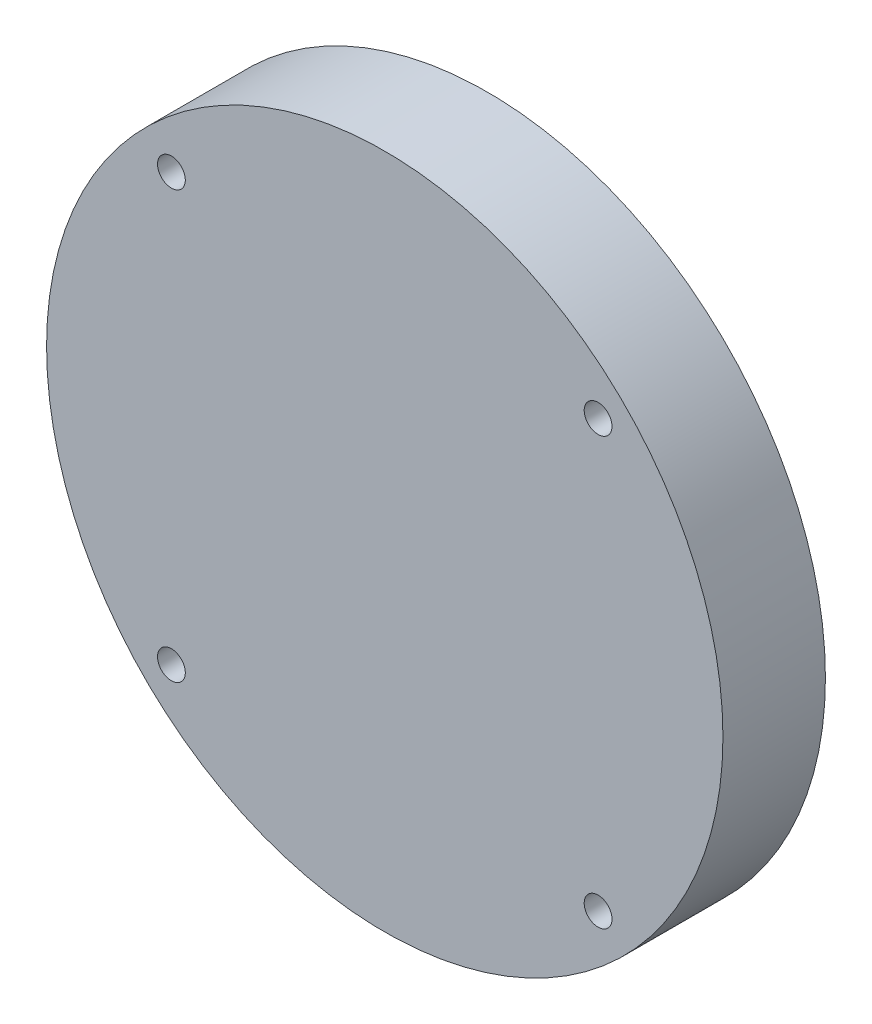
from build123d import *

# Parameters (mm, degrees)
SKETCH1_R             = 52.3875
BOSS_EXTRUDE1_DEPTH   = 15.875
F_8_CLEARANCE_HOLE1_D = 4.3053


with BuildPart() as part:
    # Sketch1 → Boss-Extrude1 (new body)
    with BuildSketch(Plane.XY):
        Circle(SKETCH1_R)
    extrude(amount=BOSS_EXTRUDE1_DEPTH)

    # 8 Clearance Hole1 (through all)
    with Locations(Plane.XY.offset(15.875)):
        with Locations((-33.047342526, 33.047342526), (33.047342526, 33.047342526), (33.047342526, -33.047342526), (-33.047342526, -33.047342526)):
            Hole(F_8_CLEARANCE_HOLE1_D / 2)


solid = part.part
